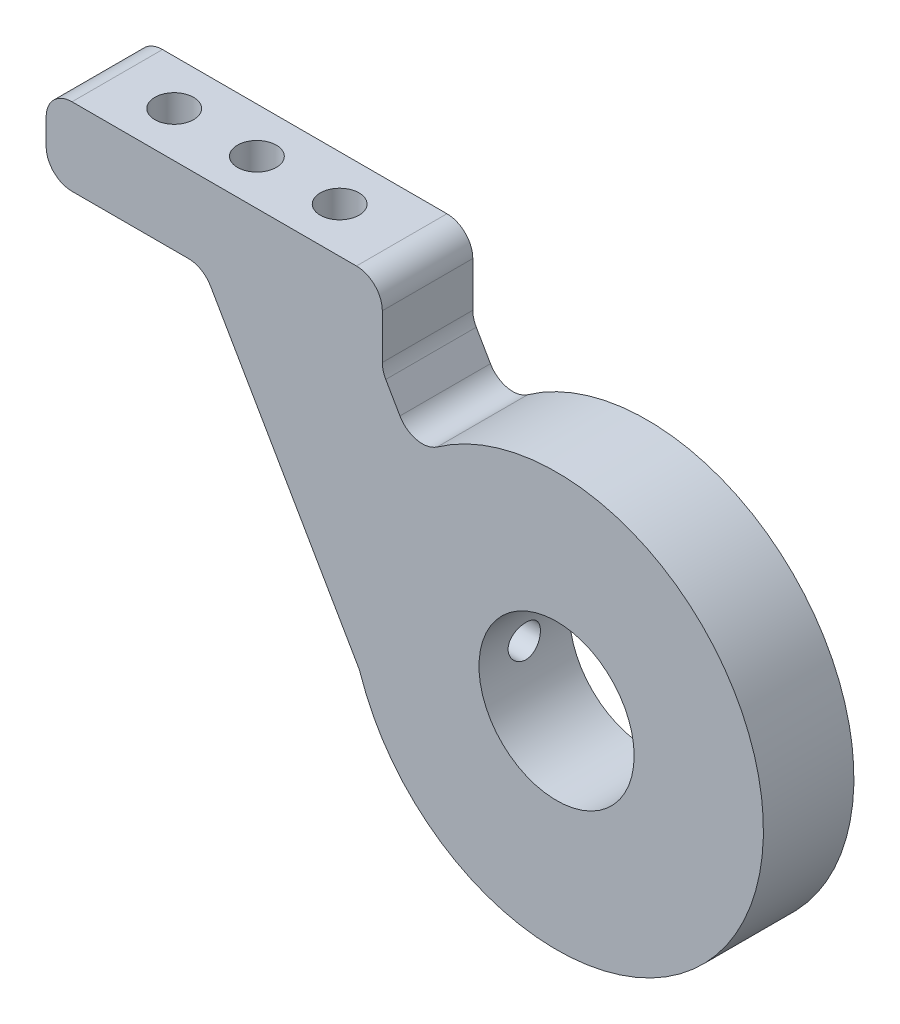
from build123d import *

# Parameters (mm, degrees)
SKETCH2_R           = 50.8
BOSS_EXTRUDE1_DEPTH = 22.225
SKETCH3_R           = 19.05
CUT_EXTRUDE1_DEPTH  = 22.225
BOSS_EXTRUDE2_START = -22.225
BOSS_EXTRUDE2_DEPTH = 22.225
CUT_EXTRUDE5_DEPTH  = 118.674329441
SKETCH23_W          = 82.55
SKETCH23_H          = 22.225
BOSS_EXTRUDE3_DEPTH = 19.05
SKETCH24_R          = 4.7625
CUT_EXTRUDE6_DEPTH  = 12.7
SKETCH25_R          = 3.96875
CUT_EXTRUDE7_DEPTH  = 171.704
SKETCH26_R          = 7.9375
CUT_EXTRUDE8_DEPTH  = 79.756
FILLET1_R           = 6.35


with BuildPart() as part:
    # Sketch2 → Boss-Extrude1 (new body)
    with BuildSketch(Plane.XY):
        Circle(SKETCH2_R)
    extrude(amount=BOSS_EXTRUDE1_DEPTH)

    # Sketch3 → Cut-Extrude1 (cut)
    with BuildSketch(Plane.XY.offset(22.225)):
        Circle(SKETCH3_R)
    extrude(amount=-CUT_EXTRUDE1_DEPTH, mode=Mode.SUBTRACT)

    # Sketch19 → Boss-Extrude2 (add)
    with BuildSketch(Plane.XY.offset(22.225).offset(BOSS_EXTRUDE2_START)):
        with BuildLine():
            Line((-34.740874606, 37.063616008), (-53.790874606, 70.059183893))
            ThreePointArc((-53.790874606, 70.059183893), (-59.574515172, 74.497127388), (-66.802266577, 73.545575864))
            Line((-66.802266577, 73.545575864), (-83.300050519, 64.020575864))
            ThreePointArc((-83.300050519, 64.020575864), (-87.737994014, 58.236935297), (-86.78644249, 51.009183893))
            Line((-86.78644249, 51.009183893), (-48.365358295, -15.538086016))
            ThreePointArc((-48.365358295, -15.538086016), (-49.177192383, 12.737493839), (-34.740874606, 37.063616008))
        make_face()
    extrude(amount=BOSS_EXTRUDE2_DEPTH)

    # Sketch21 → Cut-Extrude5 (cut, through all)
    with BuildSketch(Plane.XY.offset(22.225)):
        Polygon((-86.78644249, 51.009183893), (15.909195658, 51.009183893), (15.909195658, 107.441822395), (-101.549267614, 107.441822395), (-138.453168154, 107.441822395), (-138.453168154, 51.009183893), align=None)
    extrude(amount=-CUT_EXTRUDE5_DEPTH, mode=Mode.SUBTRACT)

    # Sketch23 → Boss-Extrude3 (add)
    with BuildSketch(Plane(origin=(0, 51.009183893, 0), x_dir=(1, 0, 0), z_dir=(0, 1, 0))):
        with Locations((-84.067351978, -11.1125)):
            Rectangle(SKETCH23_W, SKETCH23_H)
    extrude(amount=BOSS_EXTRUDE3_DEPTH)

    # Sketch24 → Cut-Extrude6 (cut)
    with BuildSketch(Plane(origin=(0, 70.059183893, 0), x_dir=(1, 0, 0), z_dir=(0, 1, 0))):
        with Locations(Location((-105.022351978, -11.1125, 0), (0, 0, 270))):
            Circle(SKETCH24_R)
        with Locations(Location((-64.382351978, -11.1125, 0), (0, 0, 270))):
            Circle(SKETCH24_R)
        with Locations(Location((-84.702351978, -11.1125, 0), (0, 0, 270))):
            Circle(SKETCH24_R)
    extrude(amount=-CUT_EXTRUDE6_DEPTH, mode=Mode.SUBTRACT)

    # Sketch25 → Cut-Extrude7 (cut)
    with BuildSketch(Plane(origin=(0, 0, 0), x_dir=(0, 0, -1), z_dir=(1, 0, 0))):
        with Locations((-11.1125, 0)):
            Circle(SKETCH25_R)
    extrude(amount=-CUT_EXTRUDE7_DEPTH, mode=Mode.SUBTRACT)

    # Sketch26 → Cut-Extrude8 (cut)
    with BuildSketch(Plane.ZY.offset(125.342351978)):
        with Locations((11.1125, 0)):
            Circle(SKETCH26_R)
    extrude(amount=-CUT_EXTRUDE8_DEPTH, mode=Mode.SUBTRACT)

    # Fillet1
    fillet1_edges = [part.edges().sort_by_distance(p)[0] for p in [
        (-34.740874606, 37.063616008, 11.1125),
        (-48.365358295, -15.538086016, 11.1125),
        (-86.78644249, 51.009183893, 11.1125),
        (-42.792351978, 51.009183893, 11.1125),
        (-125.342351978, 51.009183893, 11.1125),
        (-42.792351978, 70.059183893, 11.1125),
        (-125.342351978, 70.059183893, 11.1125),
    ]]
    fillet(fillet1_edges, radius=FILLET1_R)


solid = part.part
